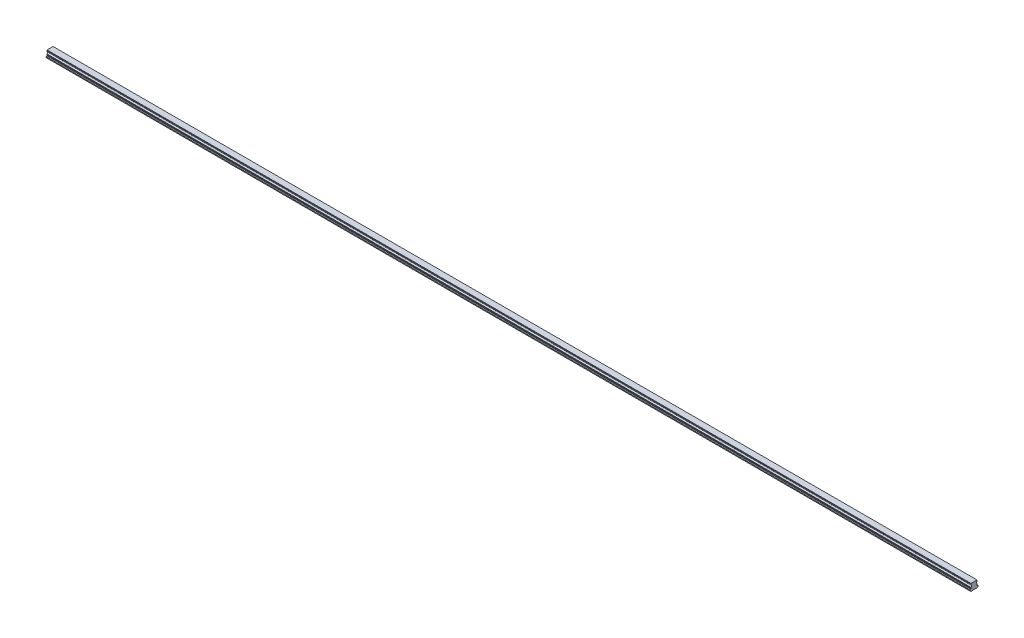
from build123d import *

# Parameters (mm, degrees)
BOSS_EXTRUDE1_DEPTH        = 2880
SKETCH3_R                  = 3
SKETCH3_R_2                = 2.5
CUT_EXTRUDE3_DEPTH         = 12
SKETCH3_2_R                = 2.5
CUT_EXTRUDE4_DEPTH         = 15
CHAMFER1_SIZE              = 0.5
LPATTERN4_COUNT            = 48
LPATTERN4_PITCH            = 60
CHAMFER1_OF_LPATTERN4_SIZE = 0.5


with BuildPart() as part:
    # Sketch1 → Boss-Extrude1 (new body)
    with BuildSketch(Plane(origin=(0, 0, 0), x_dir=(0, 0, -1), z_dir=(1, 0, 0))):
        with BuildLine():
            Line((9.375, 21.8), (-9.375, 21.8))
            Line((-9.375, 21.8), (-9.375, 20.756))
            Line((-9.375, 20.756), (-10, 19.415683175))
            Line((-10, 19.415683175), (-10, 17.685449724))
            ThreePointArc((-10, 17.685449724), (-7.2, 14.6), (-10, 11.514550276))
            Line((-10, 11.514550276), (-10, 9.784316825))
            Line((-10, 9.784316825), (-9.375, 8.444))
            Line((-9.375, 8.444), (-9.922688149, 6.4))
            Line((-9.922688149, 6.4), (-12.5, 5.489338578))
            Line((-12.5, 5.489338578), (-12.5, 2.65))
            Line((-12.5, 2.65), (-9.85, 0))
            Line((-9.85, 0), (-5.5, 0))
            Line((-5.5, 0), (-5, 0.5))
            Line((-5, 0.5), (5, 0.5))
            Line((5, 0.5), (5.5, 0))
            Line((5.5, 0), (9.85, 0))
            Line((9.85, 0), (12.5, 2.65))
            Line((12.5, 2.65), (12.5, 5.489338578))
            Line((12.5, 5.489338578), (9.922688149, 6.4))
            Line((9.922688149, 6.4), (9.375, 8.444))
            Line((9.375, 8.444), (10, 9.784316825))
            Line((10, 9.784316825), (10, 11.514550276))
            ThreePointArc((10, 11.514550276), (7.2, 14.6), (10, 17.685449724))
            Line((10, 17.685449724), (10, 19.415683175))
            Line((10, 19.415683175), (9.375, 20.756))
            Line((9.375, 20.756), (9.375, 21.8))
        make_face()
    extrude(amount=BOSS_EXTRUDE1_DEPTH)

    # Sketch3 → Cut-Extrude3 (cut)
    with BuildSketch(Plane.XZ):
        with Locations(Location((30, 0, 0), (0, 0, 270))):
            Circle(SKETCH3_R)
        with Locations(Location((30, 0, 0), (0, 0, 270))):
            Circle(SKETCH3_R_2, mode=Mode.SUBTRACT)
    cut_extrude3 = extrude(amount=-CUT_EXTRUDE3_DEPTH, mode=Mode.SUBTRACT)

    # Sketch3_2 → Cut-Extrude4 (cut)
    with BuildSketch(Plane.XZ):
        with Locations(Location((30, 0, 0), (0, 0, 270))):
            Circle(SKETCH3_2_R)
    cut_extrude4 = extrude(amount=-CUT_EXTRUDE4_DEPTH, mode=Mode.SUBTRACT)

    # Cut-Extrude5 cone 1 section (on through the dimple's axis) → Cut-Extrude5 (revolve, cut)
    with BuildSketch(Plane(origin=(30, 15, 0), x_dir=(0, 0, -1), z_dir=(1, 0, 0))):
        Polygon((0, 0), (2.5, 0), (0, 1.443375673), align=None)
    cut_extrude5 = revolve(axis=Axis((30, 15, 0), (0, 1, 0)), mode=Mode.SUBTRACT)

    # Chamfer1
    chamfer1_edges = [part.edges().sort_by_distance(p)[0] for p in [
        (30, 0.5, 3),
    ]]
    chamfer(chamfer1_edges, length=CHAMFER1_SIZE)

    # LPattern4: Cut-Extrude3, Cut-Extrude4, Cut-Extrude5 ×48
    with Locations(*[(i * LPATTERN4_PITCH, 0, 0) for i in range(1, LPATTERN4_COUNT)]):
        add(cut_extrude3, mode=Mode.SUBTRACT)
        add(cut_extrude4, mode=Mode.SUBTRACT)
        add(cut_extrude5, mode=Mode.SUBTRACT)

    # Chamfer1 of LPattern4
    chamfer1_of_lpattern4_edges = [part.edges().sort_by_distance(p)[0] for p in [
        (90, 0.5, 3),
        (150, 0.5, 3),
        (210, 0.5, 3),
        (270, 0.5, 3),
        (330, 0.5, 3),
        (390, 0.5, 3),
        (450, 0.5, 3),
        (510, 0.5, 3),
        (570, 0.5, 3),
        (630, 0.5, 3),
        (690, 0.5, 3),
        (750, 0.5, 3),
        (810, 0.5, 3),
        (870, 0.5, 3),
        (930, 0.5, 3),
        (990, 0.5, 3),
        (1050, 0.5, 3),
        (1110, 0.5, 3),
        (1170, 0.5, 3),
        (1230, 0.5, 3),
        (1290, 0.5, 3),
        (1350, 0.5, 3),
        (1410, 0.5, 3),
        (1470, 0.5, 3),
        (1530, 0.5, 3),
        (1590, 0.5, 3),
        (1650, 0.5, 3),
        (1710, 0.5, 3),
        (1770, 0.5, 3),
        (1830, 0.5, 3),
        (1890, 0.5, 3),
        (1950, 0.5, 3),
        (2010, 0.5, 3),
        (2070, 0.5, 3),
        (2130, 0.5, 3),
        (2190, 0.5, 3),
        (2250, 0.5, 3),
        (2310, 0.5, 3),
        (2370, 0.5, 3),
        (2430, 0.5, 3),
        (2490, 0.5, 3),
        (2550, 0.5, 3),
        (2610, 0.5, 3),
        (2670, 0.5, 3),
        (2730, 0.5, 3),
        (2790, 0.5, 3),
        (2850, 0.5, 3),
    ]]
    chamfer(chamfer1_of_lpattern4_edges, length=CHAMFER1_OF_LPATTERN4_SIZE)


solid = part.part
